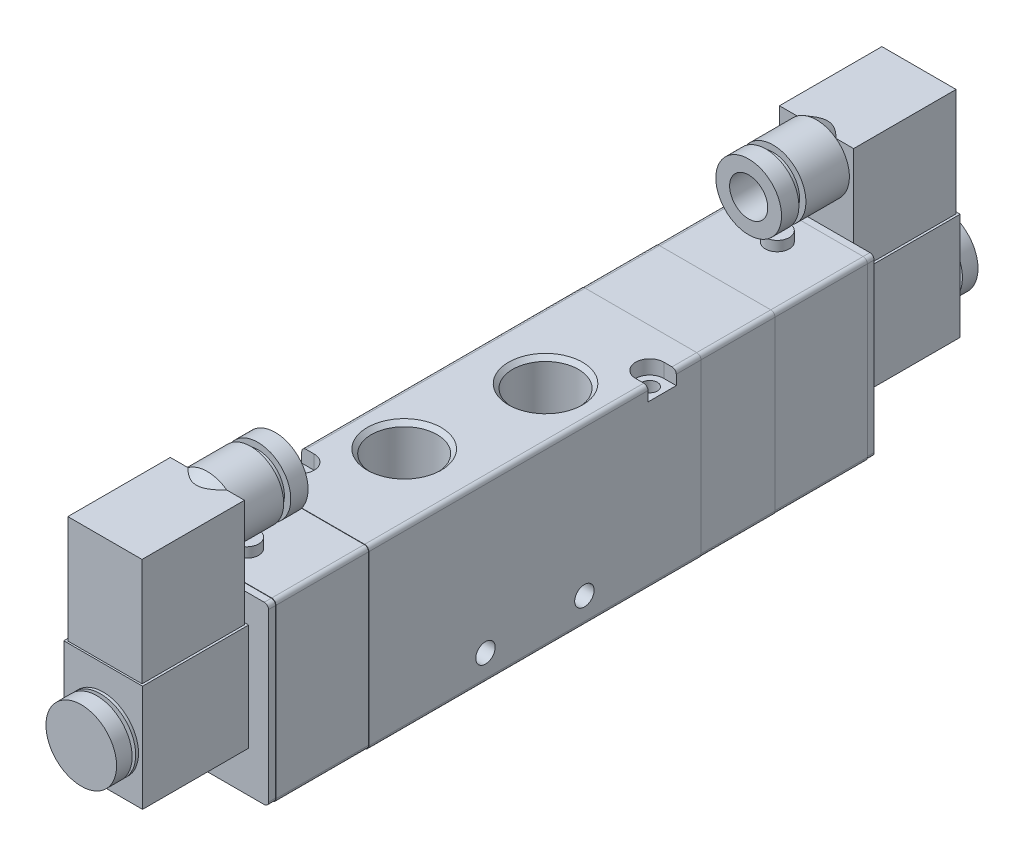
from build123d import *

# Parameters (mm, degrees)
EXTRUDE_1_DEPTH          = 94
CUT_EXTRUDE_1_DEPTH      = 25
CUT_EXTRUDE_1_DEPTH_BACK = 25
SKETCH_2_R               = 2.15
CUT_EXTRUDE_2_DEPTH      = 25
CUT_EXTRUDE_2_DEPTH_BACK = 25
SKETCH_3_R               = 2.15
CUT_EXTRUDE_3_DEPTH      = 4
CUT_EXTRUDE_4_DEPTH      = 4
CUT_EXTRUDE_5_DEPTH      = 17
CUT_EXTRUDE_5_DEPTH_BACK = 17
SKETCH_8_R               = 2.75
CUT_EXTRUDE_6_DEPTH      = 17
CUT_EXTRUDE_6_DEPTH_BACK = 17
SKETCH_9_R               = 2.75
EXTRUDE_2_DEPTH          = 26.2
SKETCH_14_W              = 3.4
SKETCH_14_H              = 2.8
EXTRUDE_3_DEPTH          = 28.2
EXTRUDE_4_DEPTH          = 11.15
EXTRUDE_4_DEPTH_BACK     = 11.15
SKETCH_16_W              = 30
SKETCH_16_H              = 30.2
SKETCH_18_W              = 21
SKETCH_18_H              = 29
EXTRUDE_5_DEPTH          = 47.5
EXTRUDE_6_DEPTH          = 21
EXTRUDE_START            = -47.2
EXTRUDE_7_DEPTH          = 47.2
EXTRUDE_START_2          = -49.2
EXTRUDE_8_DEPTH          = 49.2
SKETCH_23_W              = 3.4
SKETCH_23_H              = 2.8
EXTRUDE_9_DEPTH          = 11.15
EXTRUDE_9_DEPTH_BACK     = 11.15
SKETCH_24_W              = 30
SKETCH_24_H              = 30.2
SKETCH_26_W              = 21
SKETCH_26_H              = 29
EXTRUDE_10_DEPTH         = 47.5


with BuildPart() as part:
    # Sketch 1 → Extrude 1 (new body)
    with BuildSketch(Plane.XY):
        with BuildLine():
            Line((-17, 23.8), (-17, -23.8))
            ThreePointArc((-17, -23.8), (-16.648528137, -24.648528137), (-15.8, -25))
            Line((-15.8, -25), (15.8, -25))
            ThreePointArc((15.8, -25), (16.648528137, -24.648528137), (17, -23.8))
            Line((17, -23.8), (17, 23.8))
            ThreePointArc((17, 23.8), (16.648528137, 24.648528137), (15.8, 25))
            Line((15.8, 25), (-15.8, 25))
            ThreePointArc((-15.8, 25), (-16.648528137, 24.648528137), (-17, 23.8))
        make_face()
    extrude(amount=-EXTRUDE_1_DEPTH)

    # Sketch 2 → Cut-Extrude 1 (cut, two sides: drawn at the far end of the back side and taken through both)
    with BuildSketch(Plane(origin=(0, 0, 0), x_dir=(1, 0, 0), z_dir=(0, 1, 0)).offset(-CUT_EXTRUDE_1_DEPTH_BACK)):
        with Locations(Location((-13.5, 11, 0), (0, 0, 270))):
            Circle(SKETCH_2_R)
    extrude(amount=CUT_EXTRUDE_1_DEPTH + CUT_EXTRUDE_1_DEPTH_BACK, mode=Mode.SUBTRACT)

    # Sketch 3 → Cut-Extrude 2 (cut, two sides: drawn at the far end of the back side and taken through both)
    with BuildSketch(Plane(origin=(0, 0, 0), x_dir=(1, 0, 0), z_dir=(0, 1, 0)).offset(-CUT_EXTRUDE_2_DEPTH_BACK)):
        with Locations(Location((13.5, 83, 0), (0, 0, 270))):
            Circle(SKETCH_3_R)
    extrude(amount=CUT_EXTRUDE_2_DEPTH + CUT_EXTRUDE_2_DEPTH_BACK, mode=Mode.SUBTRACT)

    # Sketch 4 → Cut-Extrude 3 (cut)
    with BuildSketch(Plane(origin=(0, 25, 0), x_dir=(1, 0, 0), z_dir=(0, 1, 0))):
        with BuildLine():
            Line((-17, 15), (-17, 7))
            Line((-17, 7), (-13.5, 7))
            ThreePointArc((-13.5, 7), (-9.5, 11), (-13.5, 15))
            Line((-13.5, 15), (-17, 15))
        make_face()
    extrude(amount=-CUT_EXTRUDE_3_DEPTH, mode=Mode.SUBTRACT)

    # Sketch 5 → Cut-Extrude 4 (cut)
    with BuildSketch(Plane(origin=(0, 25, 0), x_dir=(1, 0, 0), z_dir=(0, 1, 0))):
        with BuildLine():
            Line((13.5, 79), (17, 79))
            Line((17, 79), (17, 87))
            Line((17, 87), (13.5, 87))
            ThreePointArc((13.5, 87), (9.5, 83), (13.5, 79))
        make_face()
    extrude(amount=-CUT_EXTRUDE_4_DEPTH, mode=Mode.SUBTRACT)

    # Sketch 6 → Cut-Revolve 1 (revolve, cut)
    with BuildSketch(Plane.XY.offset(-29), mode=Mode.PRIVATE) as cut_revolve_1_sk:
        Polygon((-2, 8.333333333), (-11.3155, 8.333333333), (-11.3155, 23.838), (-12.4775, 25), (-2, 25), align=None)
    revolve(cut_revolve_1_sk.sketch.rotate(Axis((-2, 25, -29), (0, -1, 0)), 90), axis=Axis((-2, 25, -29), (0, -1, 0)), mode=Mode.SUBTRACT)

    # Sketch 7 → Cut-Revolve 2 (revolve, cut)
    with BuildSketch(Plane.XY.offset(-65), mode=Mode.PRIVATE) as cut_revolve_2_sk:
        Polygon((2, 25), (12.4775, 25), (11.3155, 23.838), (11.3155, 8.333333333), (2, 8.333333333), align=None)
    revolve(cut_revolve_2_sk.sketch.rotate(Axis((2, 8.333333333, -65), (0, 1, 0)), 270), axis=Axis((2, 8.333333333, -65), (0, 1, 0)), mode=Mode.SUBTRACT)

    # Sketch 8 → Cut-Extrude 5 (cut, two sides: drawn at the far end of the back side and taken through both)
    with BuildSketch(Plane(origin=(0, 0, 0), x_dir=(0, 0, -1), z_dir=(1, 0, 0)).offset(-CUT_EXTRUDE_5_DEPTH_BACK)):
        with Locations((33, -17.5)):
            Circle(SKETCH_8_R)
    extrude(amount=CUT_EXTRUDE_5_DEPTH + CUT_EXTRUDE_5_DEPTH_BACK, mode=Mode.SUBTRACT)

    # Sketch 9 → Cut-Extrude 6 (cut, two sides: drawn at the far end of the back side and taken through both)
    with BuildSketch(Plane(origin=(0, 0, 0), x_dir=(0, 0, -1), z_dir=(1, 0, 0)).offset(-CUT_EXTRUDE_6_DEPTH_BACK)):
        with Locations((61, -17.5)):
            Circle(SKETCH_9_R)
    extrude(amount=CUT_EXTRUDE_6_DEPTH + CUT_EXTRUDE_6_DEPTH_BACK, mode=Mode.SUBTRACT)

    # Sketch 10 → Cut-Revolve 3 (revolve, cut)
    with BuildSketch(Plane(origin=(0, 0, 0), x_dir=(0, 0, -1), z_dir=(1, 0, 0)), mode=Mode.PRIVATE) as cut_revolve_3_sk:
        Polygon((15.5, -8.333333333), (24.8155, -8.333333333), (24.8155, -23.838), (25.9775, -25), (15.5, -25), align=None)
    revolve(cut_revolve_3_sk.sketch.rotate(Axis((0, -25, -15.5), (0, 1, 0)), 180), axis=Axis((0, -25, -15.5), (0, 1, 0)), mode=Mode.SUBTRACT)

    # Sketch 11 → Cut-Revolve 4 (revolve, cut)
    with BuildSketch(Plane(origin=(0, 0, 0), x_dir=(0, 0, -1), z_dir=(1, 0, 0)), mode=Mode.PRIVATE) as cut_revolve_4_sk:
        Polygon((47, -25), (36.5225, -25), (37.6845, -23.838), (37.6845, -8.333333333), (47, -8.333333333), align=None)
    revolve(cut_revolve_4_sk.sketch.rotate(Axis((0, -8.333333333, -47), (0, -1, 0)), 180), axis=Axis((0, -8.333333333, -47), (0, -1, 0)), mode=Mode.SUBTRACT)

    # Sketch 12 → Cut-Revolve 5 (revolve, cut)
    with BuildSketch(Plane(origin=(0, 0, 0), x_dir=(0, 0, -1), z_dir=(1, 0, 0)), mode=Mode.PRIVATE) as cut_revolve_5_sk:
        Polygon((78.5, -25), (68.0225, -25), (69.1845, -23.838), (69.1845, -8.333333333), (78.5, -8.333333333), align=None)
    revolve(cut_revolve_5_sk.sketch.rotate(Axis((0, -8.333333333, -78.5), (0, -1, 0)), 180), axis=Axis((0, -8.333333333, -78.5), (0, -1, 0)), mode=Mode.SUBTRACT)

    # Sketch 13 → Extrude 2 (add)
    with BuildSketch(Plane.XY):
        with BuildLine():
            Line((-16.9, 23.7), (-16.9, -23.7))
            ThreePointArc((-16.9, -23.7), (-16.548528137, -24.548528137), (-15.7, -24.9))
            Line((-15.7, -24.9), (15.7, -24.9))
            ThreePointArc((15.7, -24.9), (16.548528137, -24.548528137), (16.9, -23.7))
            Line((16.9, -23.7), (16.9, 23.7))
            ThreePointArc((16.9, 23.7), (16.548528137, 24.548528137), (15.7, 24.9))
            Line((15.7, 24.9), (-15.7, 24.9))
            ThreePointArc((-15.7, 24.9), (-16.548528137, 24.548528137), (-16.9, 23.7))
        make_face()
    extrude(amount=EXTRUDE_2_DEPTH)

    # Sketch 14 → Revolve 1 (revolve)
    with BuildSketch(Plane(origin=(0, 0, 0), x_dir=(0, 0, -1), z_dir=(1, 0, 0)), mode=Mode.PRIVATE) as revolve_1_sk:
        with Locations((-15.9, 26.3)):
            Rectangle(SKETCH_14_W, SKETCH_14_H)
    revolve(revolve_1_sk.sketch.rotate(Axis((0, 24.9, 17.6), (0, 1, 0)), 180), axis=Axis((0, 24.9, 17.6), (0, 1, 0)))

    # Sketch 15 → Extrude 3 (add)
    with BuildSketch(Plane.XY):
        with BuildLine():
            Line((-16.8, 23.6), (-16.8, -23.6))
            ThreePointArc((-16.8, -23.6), (-16.448528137, -24.448528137), (-15.6, -24.8))
            Line((-15.6, -24.8), (15.6, -24.8))
            ThreePointArc((15.6, -24.8), (16.448528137, -24.448528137), (16.8, -23.6))
            Line((16.8, -23.6), (16.8, 23.6))
            ThreePointArc((16.8, 23.6), (16.448528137, 24.448528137), (15.6, 24.8))
            Line((15.6, 24.8), (-15.6, 24.8))
            ThreePointArc((-15.6, 24.8), (-16.448528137, 24.448528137), (-16.8, 23.6))
        make_face()
    extrude(amount=EXTRUDE_3_DEPTH)

    # Sketch 16 → Extrude 4 (add, two sides: drawn at the far end of the back side and taken through both)
    with BuildSketch(Plane(origin=(0, 0, 0), x_dir=(0, 0, -1), z_dir=(1, 0, 0)).offset(-EXTRUDE_4_DEPTH_BACK)):
        with Locations((-43.2, 1.9)):
            Rectangle(SKETCH_16_W, SKETCH_16_H)
    extrude(amount=EXTRUDE_4_DEPTH + EXTRUDE_4_DEPTH_BACK)

    # Sketch 17 → Revolve 2 (revolve)
    with BuildSketch(Plane(origin=(0, 0, 0), x_dir=(0, 0, -1), z_dir=(1, 0, 0)), mode=Mode.PRIVATE) as revolve_2_sk:
        Polygon((-64.4, 0), (-64.4, 10), (-60, 10), (-60, 7.5), (-59, 7.5), (-59, 10), (-58.2, 10), (-58.2, 0), align=None)
    revolve(revolve_2_sk.sketch.rotate(Axis((0, 0, 58.2), (0, 0, 1)), 270), axis=Axis((0, 0, 58.2), (0, 0, 1)))

    # Sketch 18 → Extrude 5 (add)
    with BuildSketch(Plane(origin=(0, 0, 0), x_dir=(1, 0, 0), z_dir=(0, 1, 0))):
        with Locations((0, -43.2)):
            Rectangle(SKETCH_18_W, SKETCH_18_H)
    extrude(amount=EXTRUDE_5_DEPTH)

    # Sketch 19 → Revolve 3 (revolve)
    with BuildSketch(Plane(origin=(0, 0, 0), x_dir=(0, 0, -1), z_dir=(1, 0, 0)), mode=Mode.PRIVATE) as revolve_3_sk:
        Polygon((-28.7, 40), (-28.7, 34.6), (-9.5, 34.6), (-9.5, 30.7), (-14.4, 30.7), (-14.4, 32.5), (-16.4, 32.5), (-16.4, 30.7), (-28.7, 30.7), (-44.80807251, 40), align=None)
    revolve(revolve_3_sk.sketch.rotate(Axis((0, 40, 44.80807251), (0, 0, -1)), 90), axis=Axis((0, 40, 44.80807251), (0, 0, -1)))

    # Sketch 20 → Extrude 6 (add)
    with BuildSketch(Plane.XY.offset(-94)):
        with BuildLine():
            Line((-16.95, 23.75), (-16.95, -23.75))
            ThreePointArc((-16.95, -23.75), (-16.598528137, -24.598528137), (-15.75, -24.95))
            Line((-15.75, -24.95), (15.75, -24.95))
            ThreePointArc((15.75, -24.95), (16.598528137, -24.598528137), (16.95, -23.75))
            Line((16.95, -23.75), (16.95, 23.75))
            ThreePointArc((16.95, 23.75), (16.598528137, 24.598528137), (15.75, 24.95))
            Line((15.75, 24.95), (-15.75, 24.95))
            ThreePointArc((-15.75, 24.95), (-16.598528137, 24.598528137), (-16.95, 23.75))
        make_face()
    extrude(amount=-EXTRUDE_6_DEPTH)

    # Sketch 21 → Extrude 7 (add)
    with BuildSketch(Plane.XY.offset(-94).offset(EXTRUDE_START)):
        with BuildLine():
            Line((-16.9, 23.7), (-16.9, -23.7))
            ThreePointArc((-16.9, -23.7), (-16.548528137, -24.548528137), (-15.7, -24.9))
            Line((-15.7, -24.9), (15.7, -24.9))
            ThreePointArc((15.7, -24.9), (16.548528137, -24.548528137), (16.9, -23.7))
            Line((16.9, -23.7), (16.9, 23.7))
            ThreePointArc((16.9, 23.7), (16.548528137, 24.548528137), (15.7, 24.9))
            Line((15.7, 24.9), (-15.7, 24.9))
            ThreePointArc((-15.7, 24.9), (-16.548528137, 24.548528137), (-16.9, 23.7))
        make_face()
    extrude(amount=EXTRUDE_7_DEPTH)

    # Sketch 22 → Extrude 8 (add)
    with BuildSketch(Plane.XY.offset(-94).offset(EXTRUDE_START_2)):
        with BuildLine():
            Line((-16.8, 23.6), (-16.8, -23.6))
            ThreePointArc((-16.8, -23.6), (-16.448528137, -24.448528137), (-15.6, -24.8))
            Line((-15.6, -24.8), (15.6, -24.8))
            ThreePointArc((15.6, -24.8), (16.448528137, -24.448528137), (16.8, -23.6))
            Line((16.8, -23.6), (16.8, 23.6))
            ThreePointArc((16.8, 23.6), (16.448528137, 24.448528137), (15.6, 24.8))
            Line((15.6, 24.8), (-15.6, 24.8))
            ThreePointArc((-15.6, 24.8), (-16.448528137, 24.448528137), (-16.8, 23.6))
        make_face()
    extrude(amount=EXTRUDE_8_DEPTH)

    # Sketch 23 → Revolve 4 (revolve)
    with BuildSketch(Plane(origin=(0, 0, 0), x_dir=(0, 0, -1), z_dir=(1, 0, 0)), mode=Mode.PRIVATE) as revolve_4_sk:
        with Locations((134.3, 26.3)):
            Rectangle(SKETCH_23_W, SKETCH_23_H)
    revolve(revolve_4_sk.sketch.rotate(Axis((0, 24.9, -132.6), (0, 1, 0)), 180), axis=Axis((0, 24.9, -132.6), (0, 1, 0)))

    # Sketch 24 → Extrude 9 (add, two sides: drawn at the far end of the back side and taken through both)
    with BuildSketch(Plane(origin=(0, 0, 0), x_dir=(0, 0, -1), z_dir=(1, 0, 0)).offset(-EXTRUDE_9_DEPTH_BACK)):
        with Locations((158.2, 1.9)):
            Rectangle(SKETCH_24_W, SKETCH_24_H)
    extrude(amount=EXTRUDE_9_DEPTH + EXTRUDE_9_DEPTH_BACK)

    # Sketch 25 → Revolve 5 (revolve)
    with BuildSketch(Plane(origin=(0, 0, 0), x_dir=(0, 0, -1), z_dir=(1, 0, 0)), mode=Mode.PRIVATE) as revolve_5_sk:
        Polygon((173.2, 0), (173.2, 10), (174, 10), (174, 7.5), (175, 7.5), (175, 10), (179.4, 10), (179.4, 0), align=None)
    revolve(revolve_5_sk.sketch.rotate(Axis((0, 0, -179.4), (0, 0, 1)), 270), axis=Axis((0, 0, -179.4), (0, 0, 1)))

    # Sketch 26 → Extrude 10 (add)
    with BuildSketch(Plane(origin=(0, 0, 0), x_dir=(1, 0, 0), z_dir=(0, 1, 0))):
        with Locations((0, 158.2)):
            Rectangle(SKETCH_26_W, SKETCH_26_H)
    extrude(amount=EXTRUDE_10_DEPTH)

    # Sketch 27 → Revolve 6 (revolve)
    with BuildSketch(Plane(origin=(0, 0, 0), x_dir=(0, 0, -1), z_dir=(1, 0, 0)), mode=Mode.PRIVATE) as revolve_6_sk:
        Polygon((159.80807251, 40), (143.7, 30.7), (131.4, 30.7), (131.4, 32.5), (129.4, 32.5), (129.4, 30.7), (124.5, 30.7), (124.5, 34.6), (143.7, 34.6), (143.7, 40), align=None)
    revolve(revolve_6_sk.sketch.rotate(Axis((0, 40, -124.5), (0, 0, -1)), 90), axis=Axis((0, 40, -124.5), (0, 0, -1)))


solid = part.part
